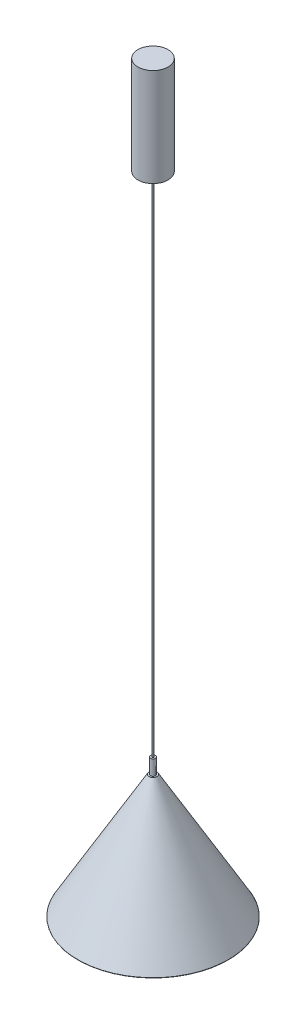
ISO-10303-21;
HEADER;
FILE_DESCRIPTION(('STEP AP214'),'2;1');
FILE_NAME('part.step','',(''),(''),'','','');
FILE_SCHEMA(('AUTOMOTIVE_DESIGN { 1 0 10303 214 1 1 1 1 }'));
ENDSEC;
DATA;
#1=APPLICATION_CONTEXT('core data for automotive mechanical design processes');
#2=APPLICATION_PROTOCOL_DEFINITION('international standard','automotive_design',2000,#1);
#3=PRODUCT_CONTEXT('',#1,'mechanical');
#4=PRODUCT('Part','Part','',(#3));
#5=PRODUCT_RELATED_PRODUCT_CATEGORY('part','',(#4));
#6=PRODUCT_DEFINITION_FORMATION('','',#4);
#7=PRODUCT_DEFINITION_CONTEXT('part definition',#1,'design');
#8=PRODUCT_DEFINITION('design','',#6,#7);
#9=PRODUCT_DEFINITION_SHAPE('','',#8);
#10=(LENGTH_UNIT() NAMED_UNIT(*) SI_UNIT(.MILLI.,.METRE.));
#11=(NAMED_UNIT(*) PLANE_ANGLE_UNIT() SI_UNIT($,.RADIAN.));
#12=(NAMED_UNIT(*) SI_UNIT($,.STERADIAN.) SOLID_ANGLE_UNIT());
#13=UNCERTAINTY_MEASURE_WITH_UNIT(LENGTH_MEASURE(1.E-05),#10,'distance_accuracy_value','');
#14=(GEOMETRIC_REPRESENTATION_CONTEXT(3) GLOBAL_UNCERTAINTY_ASSIGNED_CONTEXT((#13)) GLOBAL_UNIT_ASSIGNED_CONTEXT((#10,
#11,#12)) REPRESENTATION_CONTEXT('',''));
#15=CARTESIAN_POINT('',(0.,0.,0.));
#16=DIRECTION('',(0.,0.,1.));
#17=DIRECTION('',(1.,0.,0.));
#18=AXIS2_PLACEMENT_3D('',#15,#16,#17);
#19=CARTESIAN_POINT('',(-6.86601400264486,-882.372962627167,690.));
#20=DIRECTION('',(0.,1.,0.));
#21=DIRECTION('',(-0.979846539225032,0.,-0.199751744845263));
#22=AXIS2_PLACEMENT_3D('',#19,#20,#21);
#23=CYLINDRICAL_SURFACE('',#22,5.);
#24=CARTESIAN_POINT('',(-6.86601400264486,-882.372962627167,690.));
#25=DIRECTION('',(0.,-1.,0.));
#26=DIRECTION('',(0.979846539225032,0.,0.199751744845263));
#27=AXIS2_PLACEMENT_3D('',#24,#25,#26);
#28=CIRCLE('',#27,5.);
#29=CARTESIAN_POINT('',(-11.76524669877,-882.372962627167,689.001241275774));
#30=VERTEX_POINT('',#29);
#31=EDGE_CURVE('P0_E9',#30,#30,#28,.T.);
#32=CARTESIAN_POINT('',(-6.86601400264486,-882.362962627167,690.));
#33=DIRECTION('',(0.,-1.,0.));
#34=DIRECTION('',(0.979846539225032,0.,0.199751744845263));
#35=AXIS2_PLACEMENT_3D('',#32,#33,#34);
#36=CIRCLE('',#35,5.);
#37=CARTESIAN_POINT('',(-11.76524669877,-882.362962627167,689.001241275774));
#38=VERTEX_POINT('',#37);
#39=EDGE_CURVE('P0_E17',#38,#38,#36,.T.);
#40=CARTESIAN_POINT('',(-11.76524669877,-882.372962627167,689.001241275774));
#41=CARTESIAN_POINT('',(-11.76524669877,-882.3728584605,689.001241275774));
#42=CARTESIAN_POINT('',(-11.76524669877,-882.372754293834,689.001241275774));
#43=CARTESIAN_POINT('',(-11.76524669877,-882.3725459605,689.001241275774));
#44=CARTESIAN_POINT('',(-11.76524669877,-882.372441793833,689.001241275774));
#45=CARTESIAN_POINT('',(-11.76524669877,-882.3722334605,689.001241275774));
#46=CARTESIAN_POINT('',(-11.76524669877,-882.372129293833,689.001241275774));
#47=CARTESIAN_POINT('',(-11.76524669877,-882.3719209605,689.001241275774));
#48=CARTESIAN_POINT('',(-11.76524669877,-882.371816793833,689.001241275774));
#49=CARTESIAN_POINT('',(-11.76524669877,-882.3716084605,689.001241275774));
#50=CARTESIAN_POINT('',(-11.76524669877,-882.371504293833,689.001241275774));
#51=CARTESIAN_POINT('',(-11.76524669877,-882.3712959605,689.001241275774));
#52=CARTESIAN_POINT('',(-11.76524669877,-882.371191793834,689.001241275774));
#53=CARTESIAN_POINT('',(-11.76524669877,-882.3709834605,689.001241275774));
#54=CARTESIAN_POINT('',(-11.76524669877,-882.370879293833,689.001241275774));
#55=CARTESIAN_POINT('',(-11.76524669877,-882.3706709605,689.001241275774));
#56=CARTESIAN_POINT('',(-11.76524669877,-882.370566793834,689.001241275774));
#57=CARTESIAN_POINT('',(-11.76524669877,-882.3703584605,689.001241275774));
#58=CARTESIAN_POINT('',(-11.76524669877,-882.370254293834,689.001241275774));
#59=CARTESIAN_POINT('',(-11.76524669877,-882.3700459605,689.001241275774));
#60=CARTESIAN_POINT('',(-11.76524669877,-882.369941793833,689.001241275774));
#61=CARTESIAN_POINT('',(-11.76524669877,-882.3697334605,689.001241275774));
#62=CARTESIAN_POINT('',(-11.76524669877,-882.369629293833,689.001241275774));
#63=CARTESIAN_POINT('',(-11.76524669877,-882.3694209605,689.001241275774));
#64=CARTESIAN_POINT('',(-11.76524669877,-882.369316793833,689.001241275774));
#65=CARTESIAN_POINT('',(-11.76524669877,-882.3691084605,689.001241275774));
#66=CARTESIAN_POINT('',(-11.76524669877,-882.369004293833,689.001241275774));
#67=CARTESIAN_POINT('',(-11.76524669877,-882.3687959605,689.001241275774));
#68=CARTESIAN_POINT('',(-11.76524669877,-882.368691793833,689.001241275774));
#69=CARTESIAN_POINT('',(-11.76524669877,-882.3684834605,689.001241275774));
#70=CARTESIAN_POINT('',(-11.76524669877,-882.368379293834,689.001241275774));
#71=CARTESIAN_POINT('',(-11.76524669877,-882.3681709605,689.001241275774));
#72=CARTESIAN_POINT('',(-11.76524669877,-882.368066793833,689.001241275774));
#73=CARTESIAN_POINT('',(-11.76524669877,-882.3678584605,689.001241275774));
#74=CARTESIAN_POINT('',(-11.76524669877,-882.367754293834,689.001241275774));
#75=CARTESIAN_POINT('',(-11.76524669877,-882.3675459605,689.001241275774));
#76=CARTESIAN_POINT('',(-11.76524669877,-882.367441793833,689.001241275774));
#77=CARTESIAN_POINT('',(-11.76524669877,-882.3672334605,689.001241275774));
#78=CARTESIAN_POINT('',(-11.76524669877,-882.367129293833,689.001241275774));
#79=CARTESIAN_POINT('',(-11.76524669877,-882.3669209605,689.001241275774));
#80=CARTESIAN_POINT('',(-11.76524669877,-882.366816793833,689.001241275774));
#81=CARTESIAN_POINT('',(-11.76524669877,-882.3666084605,689.001241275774));
#82=CARTESIAN_POINT('',(-11.76524669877,-882.366504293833,689.001241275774));
#83=CARTESIAN_POINT('',(-11.76524669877,-882.3662959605,689.001241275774));
#84=CARTESIAN_POINT('',(-11.76524669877,-882.366191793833,689.001241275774));
#85=CARTESIAN_POINT('',(-11.76524669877,-882.3659834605,689.001241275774));
#86=CARTESIAN_POINT('',(-11.76524669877,-882.365879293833,689.001241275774));
#87=CARTESIAN_POINT('',(-11.76524669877,-882.3656709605,689.001241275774));
#88=CARTESIAN_POINT('',(-11.76524669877,-882.365566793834,689.001241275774));
#89=CARTESIAN_POINT('',(-11.76524669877,-882.3653584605,689.001241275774));
#90=CARTESIAN_POINT('',(-11.76524669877,-882.365254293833,689.001241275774));
#91=CARTESIAN_POINT('',(-11.76524669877,-882.3650459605,689.001241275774));
#92=CARTESIAN_POINT('',(-11.76524669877,-882.364941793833,689.001241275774));
#93=CARTESIAN_POINT('',(-11.76524669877,-882.3647334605,689.001241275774));
#94=CARTESIAN_POINT('',(-11.76524669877,-882.364629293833,689.001241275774));
#95=CARTESIAN_POINT('',(-11.76524669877,-882.3644209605,689.001241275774));
#96=CARTESIAN_POINT('',(-11.76524669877,-882.364316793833,689.001241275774));
#97=CARTESIAN_POINT('',(-11.76524669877,-882.3641084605,689.001241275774));
#98=CARTESIAN_POINT('',(-11.76524669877,-882.364004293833,689.001241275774));
#99=CARTESIAN_POINT('',(-11.76524669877,-882.3637959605,689.001241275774));
#100=CARTESIAN_POINT('',(-11.76524669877,-882.363691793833,689.001241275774));
#101=CARTESIAN_POINT('',(-11.76524669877,-882.3634834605,689.001241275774));
#102=CARTESIAN_POINT('',(-11.76524669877,-882.363379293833,689.001241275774));
#103=CARTESIAN_POINT('',(-11.76524669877,-882.3631709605,689.001241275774));
#104=CARTESIAN_POINT('',(-11.76524669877,-882.363066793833,689.001241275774));
#105=CARTESIAN_POINT('',(-11.76524669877,-882.362962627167,689.001241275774));
#106=B_SPLINE_CURVE_WITH_KNOTS('',3,(#40,#41,#42,#43,#44,#45,#46,#47,#48,#49,#50,#51,#52,#53,
#54,#55,#56,#57,#58,#59,#60,#61,#62,#63,#64,#65,#66,#67,#68,#69,#70,#71,#72,#73,#74,#75,#76,#77,
#78,#79,#80,#81,#82,#83,#84,#85,#86,#87,#88,#89,#90,#91,#92,#93,#94,#95,#96,#97,#98,#99,#100,
#101,#102,#103,#104,#105),.UNSPECIFIED.,.F.,.F.,(4,2,2,2,2,2,2,2,2,2,2,2,2,2,2,2,2,2,2,2,2,2,2,
2,2,2,2,2,2,2,2,2,4),(0.,0.000312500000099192,0.000625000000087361,0.000937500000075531,
0.0012500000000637,0.00156250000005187,0.00187500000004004,0.00218750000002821,
0.00250000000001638,0.00281250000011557,0.00312500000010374,0.00343750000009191,
0.00375000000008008,0.00406250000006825,0.00437500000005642,0.00468750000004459,
0.00500000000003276,0.00531250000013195,0.00562500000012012,0.00593750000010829,
0.00625000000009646,0.00656250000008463,0.0068750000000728,0.00718750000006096,
0.00750000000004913,0.00781250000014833,0.0081250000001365,0.00843750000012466,
0.00875000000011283,0.009062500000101,0.00937500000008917,0.00968750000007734,
0.0100000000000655),.UNSPECIFIED.);
#107=EDGE_CURVE('P0_BSEAM14',#30,#38,#106,.T.);
#108=ORIENTED_EDGE('',*,*,#31,.F.);
#109=ORIENTED_EDGE('',*,*,#39,.T.);
#110=ORIENTED_EDGE('',*,*,#107,.T.);
#111=ORIENTED_EDGE('',*,*,#107,.F.);
#112=EDGE_LOOP('',(#108,#110,#109,#111));
#113=FACE_BOUND('',#112,.T.);
#114=ADVANCED_FACE('P0_F14',(#113),#23,.T.);
#115=CARTESIAN_POINT('',(-6.86601400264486,-882.372962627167,690.));
#116=DIRECTION('',(0.,-1.,0.));
#117=DIRECTION('',(0.979846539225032,0.,0.199751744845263));
#118=AXIS2_PLACEMENT_3D('',#115,#116,#117);
#119=PLANE('',#118);
#120=ORIENTED_EDGE('',*,*,#31,.T.);
#121=EDGE_LOOP('',(#120));
#122=FACE_BOUND('',#121,.T.);
#123=ADVANCED_FACE('P0_F29',(#122),#119,.T.);
#124=CARTESIAN_POINT('',(-6.86601400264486,-882.362962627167,690.));
#125=DIRECTION('',(0.,-1.,0.));
#126=DIRECTION('',(0.979846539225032,0.,0.199751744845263));
#127=AXIS2_PLACEMENT_3D('',#124,#125,#126);
#128=PLANE('',#127);
#129=ORIENTED_EDGE('',*,*,#39,.F.);
#130=EDGE_LOOP('',(#129));
#131=FACE_BOUND('',#130,.T.);
#132=ADVANCED_FACE('P0_F27',(#131),#128,.F.);
#133=CLOSED_SHELL('',(#114,#123,#132));
#134=MANIFOLD_SOLID_BREP('P0_B1',#133);
#135=CARTESIAN_POINT('',(-6.86601400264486,-621.411747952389,690.));
#136=DIRECTION('',(0.,-1.,0.));
#137=DIRECTION('',(0.199751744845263,0.,-0.979846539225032));
#138=AXIS2_PLACEMENT_3D('',#135,#136,#137);
#139=CYLINDRICAL_SURFACE('',#138,5.);
#140=CARTESIAN_POINT('',(-6.86601400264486,-621.411747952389,690.));
#141=DIRECTION('',(0.,1.,0.));
#142=DIRECTION('',(-0.199751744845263,0.,0.979846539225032));
#143=AXIS2_PLACEMENT_3D('',#140,#141,#142);
#144=CIRCLE('',#143,5.);
#145=CARTESIAN_POINT('',(-7.86477272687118,-621.411747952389,694.899232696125));
#146=VERTEX_POINT('',#145);
#147=EDGE_CURVE('P1_E10',#146,#146,#144,.T.);
#148=ORIENTED_EDGE('',*,*,#147,.F.);
#149=EDGE_LOOP('',(#148));
#150=FACE_BOUND('',#149,.T.);
#151=CARTESIAN_POINT('',(-6.86601400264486,-651.411747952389,690.));
#152=DIRECTION('',(0.,1.,0.));
#153=DIRECTION('',(-0.199751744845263,0.,0.979846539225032));
#154=AXIS2_PLACEMENT_3D('',#151,#152,#153);
#155=CIRCLE('',#154,5.);
#156=CARTESIAN_POINT('',(-7.86477272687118,-651.411747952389,694.899232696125));
#157=VERTEX_POINT('',#156);
#158=EDGE_CURVE('P1_E18',#157,#157,#155,.T.);
#159=ORIENTED_EDGE('',*,*,#158,.T.);
#160=EDGE_LOOP('',(#159));
#161=FACE_BOUND('',#160,.T.);
#162=ADVANCED_FACE('P1_F15',(#150,#161),#139,.T.);
#163=CARTESIAN_POINT('',(-6.86601400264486,-621.411747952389,690.));
#164=DIRECTION('',(0.,1.,0.));
#165=DIRECTION('',(-0.199751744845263,0.,0.979846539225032));
#166=AXIS2_PLACEMENT_3D('',#163,#164,#165);
#167=PLANE('',#166);
#168=ORIENTED_EDGE('',*,*,#147,.T.);
#169=EDGE_LOOP('',(#168));
#170=FACE_BOUND('',#169,.T.);
#171=ADVANCED_FACE('P1_F30',(#170),#167,.T.);
#172=CARTESIAN_POINT('',(-6.86601400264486,-651.411747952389,690.));
#173=DIRECTION('',(0.,1.,0.));
#174=DIRECTION('',(-0.199751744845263,0.,0.979846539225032));
#175=AXIS2_PLACEMENT_3D('',#172,#173,#174);
#176=PLANE('',#175);
#177=ORIENTED_EDGE('',*,*,#158,.F.);
#178=EDGE_LOOP('',(#177));
#179=FACE_BOUND('',#178,.T.);
#180=ADVANCED_FACE('P1_F28',(#179),#176,.F.);
#181=CLOSED_SHELL('',(#162,#171,#180));
#182=MANIFOLD_SOLID_BREP('P1_B1',#181);
#183=CARTESIAN_POINT('',(-6.86601400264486,-880.362962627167,690.));
#184=DIRECTION('',(0.,-1.,0.));
#185=DIRECTION('',(0.979846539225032,0.,0.199751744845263));
#186=AXIS2_PLACEMENT_3D('',#183,#184,#185);
#187=PLANE('',#186);
#188=CARTESIAN_POINT('',(-6.86601400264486,-880.362962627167,690.));
#189=DIRECTION('',(0.,-1.,0.));
#190=DIRECTION('',(0.979846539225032,0.,0.199751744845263));
#191=AXIS2_PLACEMENT_3D('',#188,#189,#190);
#192=CIRCLE('',#191,136.845299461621);
#193=CARTESIAN_POINT('',(127.221379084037,-880.362962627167,717.335087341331));
#194=VERTEX_POINT('',#193);
#195=EDGE_CURVE('P2_E10',#194,#194,#192,.T.);
#196=ORIENTED_EDGE('',*,*,#195,.F.);
#197=EDGE_LOOP('',(#196));
#198=FACE_BOUND('',#197,.T.);
#199=ADVANCED_FACE('P2_F15',(#198),#187,.F.);
#200=CARTESIAN_POINT('',(-6.86601400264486,-880.362962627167,690.));
#201=DIRECTION('',(0.,-1.,0.));
#202=DIRECTION('',(0.979846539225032,0.,0.199751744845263));
#203=AXIS2_PLACEMENT_3D('',#200,#201,#202);
#204=CONICAL_SURFACE('',#203,136.845299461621,0.52359877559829);
#205=CARTESIAN_POINT('',(-6.86601400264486,-882.362962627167,690.));
#206=DIRECTION('',(0.,-1.,0.));
#207=DIRECTION('',(0.979846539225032,0.,0.199751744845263));
#208=AXIS2_PLACEMENT_3D('',#205,#206,#207);
#209=CIRCLE('',#208,138.);
#210=CARTESIAN_POINT('',(128.35280841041,-882.362962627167,717.565740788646));
#211=VERTEX_POINT('',#210);
#212=EDGE_CURVE('P2_E21',#211,#211,#209,.T.);
#213=ORIENTED_EDGE('',*,*,#212,.F.);
#214=EDGE_LOOP('',(#213));
#215=FACE_BOUND('',#214,.T.);
#216=ORIENTED_EDGE('',*,*,#195,.T.);
#217=EDGE_LOOP('',(#216));
#218=FACE_BOUND('',#217,.T.);
#219=ADVANCED_FACE('P2_F29',(#215,#218),#204,.T.);
#220=CARTESIAN_POINT('',(-142.084836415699,-882.362962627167,662.434259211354));
#221=DIRECTION('',(0.,1.,0.));
#222=DIRECTION('',(-0.979846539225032,0.,-0.199751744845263));
#223=AXIS2_PLACEMENT_3D('',#220,#221,#222);
#224=PLANE('',#223);
#225=ORIENTED_EDGE('',*,*,#212,.T.);
#226=EDGE_LOOP('',(#225));
#227=FACE_BOUND('',#226,.T.);
#228=ADVANCED_FACE('P2_F27',(#227),#224,.F.);
#229=CLOSED_SHELL('',(#199,#219,#228));
#230=MANIFOLD_SOLID_BREP('P2_B1',#229);
#231=CARTESIAN_POINT('',(-6.86601400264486,-651.411747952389,690.));
#232=DIRECTION('',(0.,-1.,0.));
#233=DIRECTION('',(0.199751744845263,0.,-0.979846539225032));
#234=AXIS2_PLACEMENT_3D('',#231,#232,#233);
#235=PLANE('',#234);
#236=CARTESIAN_POINT('',(-6.86601400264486,-651.411747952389,690.));
#237=DIRECTION('',(0.,-1.,0.));
#238=DIRECTION('',(0.199751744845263,0.,-0.979846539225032));
#239=AXIS2_PLACEMENT_3D('',#236,#237,#238);
#240=CIRCLE('',#239,8.);
#241=CARTESIAN_POINT('',(-5.26800004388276,-651.411747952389,682.1612276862));
#242=VERTEX_POINT('',#241);
#243=EDGE_CURVE('P3_E35',#242,#242,#240,.T.);
#244=ORIENTED_EDGE('',*,*,#243,.F.);
#245=EDGE_LOOP('',(#244));
#246=FACE_BOUND('',#245,.T.);
#247=ADVANCED_FACE('P3_F15',(#246),#235,.F.);
#248=CARTESIAN_POINT('',(-6.86601400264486,-651.411747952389,690.));
#249=DIRECTION('',(0.,-1.,0.));
#250=DIRECTION('',(0.199751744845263,0.,-0.979846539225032));
#251=AXIS2_PLACEMENT_3D('',#248,#249,#250);
#252=CONICAL_SURFACE('',#251,8.,0.523598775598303);
#253=CARTESIAN_POINT('',(-6.86601400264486,-896.612962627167,690.));
#254=DIRECTION('',(0.,1.,0.));
#255=DIRECTION('',(-0.199751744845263,0.,0.979846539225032));
#256=AXIS2_PLACEMENT_3D('',#253,#254,#255);
#257=CIRCLE('',#256,149.566987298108);
#258=CARTESIAN_POINT('',(23.0102526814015,-896.612962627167,543.447305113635));
#259=VERTEX_POINT('',#258);
#260=EDGE_CURVE('P3_E22',#259,#259,#257,.T.);
#261=CARTESIAN_POINT('',(23.0102526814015,-896.612962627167,543.447305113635));
#262=CARTESIAN_POINT('',(22.7156875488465,-894.058783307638,544.892241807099));
#263=CARTESIAN_POINT('',(22.4211224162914,-891.504603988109,546.337178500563));
#264=CARTESIAN_POINT('',(21.8319921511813,-886.396245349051,549.227051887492));
#265=CARTESIAN_POINT('',(21.5374270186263,-883.842066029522,550.671988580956));
#266=CARTESIAN_POINT('',(20.9482967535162,-878.733707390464,553.561861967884));
#267=CARTESIAN_POINT('',(20.6537316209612,-876.179528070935,555.006798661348));
#268=CARTESIAN_POINT('',(20.0646013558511,-871.071169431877,557.896672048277));
#269=CARTESIAN_POINT('',(19.770036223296,-868.516990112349,559.341608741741));
#270=CARTESIAN_POINT('',(19.1809059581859,-863.408631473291,562.23148212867));
#271=CARTESIAN_POINT('',(18.8863408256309,-860.854452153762,563.676418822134));
#272=CARTESIAN_POINT('',(18.2972105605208,-855.746093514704,566.566292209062));
#273=CARTESIAN_POINT('',(18.0026454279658,-853.191914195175,568.011228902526));
#274=CARTESIAN_POINT('',(17.4135151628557,-848.083555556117,570.901102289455));
#275=CARTESIAN_POINT('',(17.1189500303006,-845.529376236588,572.346038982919));
#276=CARTESIAN_POINT('',(16.5298197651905,-840.42101759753,575.235912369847));
#277=CARTESIAN_POINT('',(16.2352546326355,-837.866838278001,576.680849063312));
#278=CARTESIAN_POINT('',(15.6461243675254,-832.758479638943,579.57072245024));
#279=CARTESIAN_POINT('',(15.3515592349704,-830.204300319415,581.015659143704));
#280=CARTESIAN_POINT('',(14.7624289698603,-825.095941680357,583.905532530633));
#281=CARTESIAN_POINT('',(14.4678638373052,-822.541762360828,585.350469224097));
#282=CARTESIAN_POINT('',(13.8787335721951,-817.43340372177,588.240342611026));
#283=CARTESIAN_POINT('',(13.5841684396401,-814.879224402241,589.68527930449));
#284=CARTESIAN_POINT('',(12.99503817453,-809.770865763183,592.575152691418));
#285=CARTESIAN_POINT('',(12.700473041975,-807.216686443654,594.020089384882));
#286=CARTESIAN_POINT('',(12.1113427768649,-802.108327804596,596.909962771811));
#287=CARTESIAN_POINT('',(11.8167776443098,-799.554148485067,598.354899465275));
#288=CARTESIAN_POINT('',(11.2276473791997,-794.445789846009,601.244772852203));
#289=CARTESIAN_POINT('',(10.9330822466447,-791.89161052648,602.689709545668));
#290=CARTESIAN_POINT('',(10.3439519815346,-786.783251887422,605.579582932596));
#291=CARTESIAN_POINT('',(10.0493868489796,-784.229072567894,607.02451962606));
#292=CARTESIAN_POINT('',(9.46025658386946,-779.120713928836,609.914393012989));
#293=CARTESIAN_POINT('',(9.16569145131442,-776.566534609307,611.359329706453));
#294=CARTESIAN_POINT('',(8.57656118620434,-771.458175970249,614.249203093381));
#295=CARTESIAN_POINT('',(8.28199605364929,-768.90399665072,615.694139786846));
#296=CARTESIAN_POINT('',(7.6928657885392,-763.795638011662,618.584013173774));
#297=CARTESIAN_POINT('',(7.39830065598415,-761.241458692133,620.028949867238));
#298=CARTESIAN_POINT('',(6.80917039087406,-756.133100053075,622.918823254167));
#299=CARTESIAN_POINT('',(6.51460525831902,-753.578920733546,624.363759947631));
#300=CARTESIAN_POINT('',(5.92547499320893,-748.470562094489,627.253633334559));
#301=CARTESIAN_POINT('',(5.63090986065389,-745.91638277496,628.698570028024));
#302=CARTESIAN_POINT('',(5.0417795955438,-740.808024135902,631.588443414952));
#303=CARTESIAN_POINT('',(4.74721446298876,-738.253844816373,633.033380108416));
#304=CARTESIAN_POINT('',(4.15808419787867,-733.145486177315,635.923253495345));
#305=CARTESIAN_POINT('',(3.86351906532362,-730.591306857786,637.368190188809));
#306=CARTESIAN_POINT('',(3.27438880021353,-725.482948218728,640.258063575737));
#307=CARTESIAN_POINT('',(2.97982366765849,-722.928768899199,641.703000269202));
#308=CARTESIAN_POINT('',(2.3906934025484,-717.820410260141,644.59287365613));
#309=CARTESIAN_POINT('',(2.09612826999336,-715.266230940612,646.037810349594));
#310=CARTESIAN_POINT('',(1.50699800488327,-710.157872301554,648.927683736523));
#311=CARTESIAN_POINT('',(1.21243287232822,-707.603692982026,650.372620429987));
#312=CARTESIAN_POINT('',(0.623302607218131,-702.495334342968,653.262493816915));
#313=CARTESIAN_POINT('',(0.328737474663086,-699.941155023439,654.707430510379));
#314=CARTESIAN_POINT('',(-0.260392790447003,-694.832796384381,657.597303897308));
#315=CARTESIAN_POINT('',(-0.554957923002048,-692.278617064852,659.042240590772));
#316=CARTESIAN_POINT('',(-1.14408818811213,-687.170258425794,661.932113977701));
#317=CARTESIAN_POINT('',(-1.43865332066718,-684.616079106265,663.377050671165));
#318=CARTESIAN_POINT('',(-2.02778358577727,-679.507720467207,666.266924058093));
#319=CARTESIAN_POINT('',(-2.32234871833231,-676.953541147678,667.711860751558));
#320=CARTESIAN_POINT('',(-2.9114789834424,-671.84518250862,670.601734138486));
#321=CARTESIAN_POINT('',(-3.20604411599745,-669.291003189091,672.04667083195));
#322=CARTESIAN_POINT('',(-3.79517438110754,-664.182644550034,674.936544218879));
#323=CARTESIAN_POINT('',(-4.08973951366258,-661.628465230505,676.381480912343));
#324=CARTESIAN_POINT('',(-4.67886977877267,-656.520106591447,679.271354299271));
#325=CARTESIAN_POINT('',(-4.97343491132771,-653.965927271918,680.716290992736));
#326=CARTESIAN_POINT('',(-5.26800004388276,-651.411747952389,682.1612276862));
#327=B_SPLINE_CURVE_WITH_KNOTS('',3,(#261,#262,#263,#264,#265,#266,#267,#268,#269,#270,#271,
#272,#273,#274,#275,#276,#277,#278,#279,#280,#281,#282,#283,#284,#285,#286,#287,#288,#289,#290,
#291,#292,#293,#294,#295,#296,#297,#298,#299,#300,#301,#302,#303,#304,#305,#306,#307,#308,#309,
#310,#311,#312,#313,#314,#315,#316,#317,#318,#319,#320,#321,#322,#323,#324,#325,#326),
.UNSPECIFIED.,.F.,.F.,(4,2,2,2,2,2,2,2,2,2,2,2,2,2,2,2,2,2,2,2,2,2,2,2,2,2,2,2,2,2,2,2,4),(0.,
8.84793670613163,17.6958734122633,26.543810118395,35.3917468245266,44.2396835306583,
53.08762023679,61.9355569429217,70.7834936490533,79.631430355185,88.4793670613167,
97.3273037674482,106.17524047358,115.023177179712,123.871113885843,132.719050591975,
141.566987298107,150.414924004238,159.26286071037,168.110797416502,176.958734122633,
185.806670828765,194.654607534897,203.502544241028,212.35048094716,221.198417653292,
230.046354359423,238.894291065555,247.742227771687,256.590164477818,265.43810118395,
274.286037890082,283.133974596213),.UNSPECIFIED.);
#328=EDGE_CURVE('P3_BSEAM58',#259,#242,#327,.T.);
#329=ORIENTED_EDGE('',*,*,#260,.T.);
#330=ORIENTED_EDGE('',*,*,#243,.T.);
#331=ORIENTED_EDGE('',*,*,#328,.T.);
#332=ORIENTED_EDGE('',*,*,#328,.F.);
#333=EDGE_LOOP('',(#329,#331,#330,#332));
#334=FACE_BOUND('',#333,.T.);
#335=ADVANCED_FACE('P3_F58',(#334),#252,.T.);
#336=CARTESIAN_POINT('',(-6.86601400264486,-897.362962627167,690.));
#337=DIRECTION('',(0.,1.,0.));
#338=DIRECTION('',(-0.199751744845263,0.,0.979846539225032));
#339=AXIS2_PLACEMENT_3D('',#336,#337,#338);
#340=PLANE('',#339);
#341=CARTESIAN_POINT('',(-6.86601400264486,-897.362962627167,690.));
#342=DIRECTION('',(0.,1.,0.));
#343=DIRECTION('',(-0.199751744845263,0.,0.979846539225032));
#344=AXIS2_PLACEMENT_3D('',#341,#342,#343);
#345=CIRCLE('',#344,149.133974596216);
#346=CARTESIAN_POINT('',(-36.6557856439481,-897.362962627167,836.128408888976));
#347=VERTEX_POINT('',#346);
#348=EDGE_CURVE('P3_E26',#347,#347,#345,.F.);
#349=ORIENTED_EDGE('',*,*,#348,.T.);
#350=EDGE_LOOP('',(#349));
#351=FACE_BOUND('',#350,.T.);
#352=CARTESIAN_POINT('',(-6.86601400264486,-897.362962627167,690.));
#353=DIRECTION('',(0.,1.,0.));
#354=DIRECTION('',(-0.199751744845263,0.,0.979846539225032));
#355=AXIS2_PLACEMENT_3D('',#352,#353,#354);
#356=CIRCLE('',#355,147.979274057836);
#357=CARTESIAN_POINT('',(-36.4251321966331,-897.362962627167,834.996979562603));
#358=VERTEX_POINT('',#357);
#359=EDGE_CURVE('P3_E30',#358,#358,#356,.T.);
#360=ORIENTED_EDGE('',*,*,#359,.T.);
#361=EDGE_LOOP('',(#360));
#362=FACE_BOUND('',#361,.T.);
#363=ADVANCED_FACE('P3_F54',(#351,#362),#340,.F.);
#364=CARTESIAN_POINT('',(-6.86601400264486,-653.411747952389,690.));
#365=DIRECTION('',(0.,-1.,0.));
#366=DIRECTION('',(0.199751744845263,0.,-0.979846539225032));
#367=AXIS2_PLACEMENT_3D('',#364,#365,#366);
#368=PLANE('',#367);
#369=CARTESIAN_POINT('',(-6.86601400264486,-653.411747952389,690.));
#370=DIRECTION('',(0.,-1.,0.));
#371=DIRECTION('',(0.199751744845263,0.,-0.979846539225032));
#372=AXIS2_PLACEMENT_3D('',#369,#370,#371);
#373=CIRCLE('',#372,6.84529946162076);
#374=CARTESIAN_POINT('',(-5.49865349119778,-653.411747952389,683.292657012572));
#375=VERTEX_POINT('',#374);
#376=EDGE_CURVE('P3_E38',#375,#375,#373,.T.);
#377=ORIENTED_EDGE('',*,*,#376,.T.);
#378=EDGE_LOOP('',(#377));
#379=FACE_BOUND('',#378,.T.);
#380=ADVANCED_FACE('P3_F42',(#379),#368,.T.);
#381=CARTESIAN_POINT('',(-6.86601400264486,-652.411747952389,690.));
#382=DIRECTION('',(0.,-1.,0.));
#383=DIRECTION('',(0.199751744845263,0.,-0.979846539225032));
#384=AXIS2_PLACEMENT_3D('',#381,#382,#383);
#385=CONICAL_SURFACE('',#384,6.26794919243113,0.523598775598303);
#386=CARTESIAN_POINT('',(-6.86601400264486,-897.112962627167,690.));
#387=DIRECTION('',(0.,-1.,0.));
#388=DIRECTION('',(0.199751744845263,0.,-0.979846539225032));
#389=AXIS2_PLACEMENT_3D('',#386,#387,#388);
#390=CIRCLE('',#389,147.546261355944);
#391=CARTESIAN_POINT('',(22.6066091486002,-897.112962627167,545.427306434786));
#392=VERTEX_POINT('',#391);
#393=EDGE_CURVE('P3_E10',#392,#392,#390,.T.);
#394=CARTESIAN_POINT('',(22.6066091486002,-897.112962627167,545.427306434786));
#395=CARTESIAN_POINT('',(22.3138459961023,-894.574408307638,546.863403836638));
#396=CARTESIAN_POINT('',(22.0210828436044,-892.035853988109,548.29950123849));
#397=CARTESIAN_POINT('',(21.4355565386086,-886.958745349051,551.171696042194));
#398=CARTESIAN_POINT('',(21.1427933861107,-884.420191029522,552.607793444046));
#399=CARTESIAN_POINT('',(20.557267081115,-879.343082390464,555.47998824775));
#400=CARTESIAN_POINT('',(20.2645039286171,-876.804528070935,556.916085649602));
#401=CARTESIAN_POINT('',(19.6789776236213,-871.727419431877,559.788280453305));
#402=CARTESIAN_POINT('',(19.3862144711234,-869.188865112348,561.224377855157));
#403=CARTESIAN_POINT('',(18.8006881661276,-864.111756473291,564.096572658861));
#404=CARTESIAN_POINT('',(18.5079250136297,-861.573202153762,565.532670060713));
#405=CARTESIAN_POINT('',(17.9223987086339,-856.496093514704,568.404864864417));
#406=CARTESIAN_POINT('',(17.629635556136,-853.957539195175,569.840962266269));
#407=CARTESIAN_POINT('',(17.0441092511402,-848.880430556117,572.713157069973));
#408=CARTESIAN_POINT('',(16.7513460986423,-846.341876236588,574.149254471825));
#409=CARTESIAN_POINT('',(16.1658197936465,-841.26476759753,577.021449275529));
#410=CARTESIAN_POINT('',(15.8730566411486,-838.726213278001,578.457546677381));
#411=CARTESIAN_POINT('',(15.2875303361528,-833.649104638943,581.329741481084));
#412=CARTESIAN_POINT('',(14.9947671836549,-831.110550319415,582.765838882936));
#413=CARTESIAN_POINT('',(14.4092408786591,-826.033441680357,585.63803368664));
#414=CARTESIAN_POINT('',(14.1164777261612,-823.494887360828,587.074131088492));
#415=CARTESIAN_POINT('',(13.5309514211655,-818.41777872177,589.946325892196));
#416=CARTESIAN_POINT('',(13.2381882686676,-815.879224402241,591.382423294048));
#417=CARTESIAN_POINT('',(12.6526619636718,-810.802115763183,594.254618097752));
#418=CARTESIAN_POINT('',(12.3598988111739,-808.263561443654,595.690715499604));
#419=CARTESIAN_POINT('',(11.7743725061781,-803.186452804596,598.562910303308));
#420=CARTESIAN_POINT('',(11.4816093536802,-800.647898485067,599.99900770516));
#421=CARTESIAN_POINT('',(10.8960830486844,-795.570789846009,602.871202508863));
#422=CARTESIAN_POINT('',(10.6033198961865,-793.03223552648,604.307299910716));
#423=CARTESIAN_POINT('',(10.0177935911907,-787.955126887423,607.179494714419));
#424=CARTESIAN_POINT('',(9.7250304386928,-785.416572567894,608.615592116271));
#425=CARTESIAN_POINT('',(9.13950413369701,-780.339463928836,611.487786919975));
#426=CARTESIAN_POINT('',(8.84674098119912,-777.800909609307,612.923884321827));
#427=CARTESIAN_POINT('',(8.26121467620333,-772.723800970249,615.796079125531));
#428=CARTESIAN_POINT('',(7.96845152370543,-770.18524665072,617.232176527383));
#429=CARTESIAN_POINT('',(7.38292521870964,-765.108138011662,620.104371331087));
#430=CARTESIAN_POINT('',(7.09016206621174,-762.569583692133,621.540468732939));
#431=CARTESIAN_POINT('',(6.50463576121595,-757.492475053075,624.412663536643));
#432=CARTESIAN_POINT('',(6.21187260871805,-754.953920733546,625.848760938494));
#433=CARTESIAN_POINT('',(5.62634630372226,-749.876812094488,628.720955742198));
#434=CARTESIAN_POINT('',(5.33358315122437,-747.33825777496,630.15705314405));
#435=CARTESIAN_POINT('',(4.74805684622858,-742.261149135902,633.029247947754));
#436=CARTESIAN_POINT('',(4.45529369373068,-739.722594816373,634.465345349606));
#437=CARTESIAN_POINT('',(3.86976738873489,-734.645486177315,637.33754015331));
#438=CARTESIAN_POINT('',(3.57700423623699,-732.106931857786,638.773637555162));
#439=CARTESIAN_POINT('',(2.9914779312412,-727.029823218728,641.645832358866));
#440=CARTESIAN_POINT('',(2.69871477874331,-724.491268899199,643.081929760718));
#441=CARTESIAN_POINT('',(2.11318847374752,-719.414160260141,645.954124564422));
#442=CARTESIAN_POINT('',(1.82042532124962,-716.875605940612,647.390221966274));
#443=CARTESIAN_POINT('',(1.23489901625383,-711.798497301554,650.262416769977));
#444=CARTESIAN_POINT('',(0.94213586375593,-709.259942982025,651.698514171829));
#445=CARTESIAN_POINT('',(0.356609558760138,-704.182834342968,654.570708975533));
#446=CARTESIAN_POINT('',(0.0638464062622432,-701.644280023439,656.006806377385));
#447=CARTESIAN_POINT('',(-0.521679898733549,-696.567171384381,658.879001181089));
#448=CARTESIAN_POINT('',(-0.814443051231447,-694.028617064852,660.315098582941));
#449=CARTESIAN_POINT('',(-1.39996935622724,-688.951508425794,663.187293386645));
#450=CARTESIAN_POINT('',(-1.69273250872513,-686.412954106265,664.623390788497));
#451=CARTESIAN_POINT('',(-2.27825881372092,-681.335845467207,667.495585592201));
#452=CARTESIAN_POINT('',(-2.57102196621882,-678.797291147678,668.931682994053));
#453=CARTESIAN_POINT('',(-3.15654827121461,-673.72018250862,671.803877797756));
#454=CARTESIAN_POINT('',(-3.44931142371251,-671.181628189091,673.239975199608));
#455=CARTESIAN_POINT('',(-4.0348377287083,-666.104519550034,676.112170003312));
#456=CARTESIAN_POINT('',(-4.32760088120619,-663.565965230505,677.548267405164));
#457=CARTESIAN_POINT('',(-4.91312718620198,-658.488856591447,680.420462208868));
#458=CARTESIAN_POINT('',(-5.20589033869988,-655.950302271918,681.85655961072));
#459=CARTESIAN_POINT('',(-5.49865349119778,-653.411747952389,683.292657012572));
#460=B_SPLINE_CURVE_WITH_KNOTS('',3,(#394,#395,#396,#397,#398,#399,#400,#401,#402,#403,#404,
#405,#406,#407,#408,#409,#410,#411,#412,#413,#414,#415,#416,#417,#418,#419,#420,#421,#422,#423,
#424,#425,#426,#427,#428,#429,#430,#431,#432,#433,#434,#435,#436,#437,#438,#439,#440,#441,#442,
#443,#444,#445,#446,#447,#448,#449,#450,#451,#452,#453,#454,#455,#456,#457,#458,#459),
.UNSPECIFIED.,.F.,.F.,(4,2,2,2,2,2,2,2,2,2,2,2,2,2,2,2,2,2,2,2,2,2,2,2,2,2,2,2,2,2,2,2,4),(0.,
8.79381011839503,17.5876202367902,26.3814303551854,35.1752404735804,43.9690505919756,
52.7628607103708,61.556670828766,70.350480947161,79.1442910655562,87.9381011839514,
96.7319113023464,105.525721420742,114.319531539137,123.113341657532,131.907151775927,
140.700961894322,149.494772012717,158.288582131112,167.082392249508,175.876202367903,
184.670012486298,193.463822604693,202.257632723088,211.051442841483,219.845252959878,
228.639063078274,237.432873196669,246.226683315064,255.020493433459,263.814303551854,
272.608113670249,281.401923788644),.UNSPECIFIED.);
#461=EDGE_CURVE('P3_BSEAM44',#392,#375,#460,.T.);
#462=ORIENTED_EDGE('',*,*,#393,.T.);
#463=ORIENTED_EDGE('',*,*,#376,.F.);
#464=ORIENTED_EDGE('',*,*,#461,.T.);
#465=ORIENTED_EDGE('',*,*,#461,.F.);
#466=EDGE_LOOP('',(#462,#464,#463,#465));
#467=FACE_BOUND('',#466,.T.);
#468=ADVANCED_FACE('P3_F44',(#467),#385,.F.);
#469=CARTESIAN_POINT('',(-6.86601400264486,-896.862962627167,690.));
#470=DIRECTION('',(0.,1.,0.));
#471=DIRECTION('',(-0.199751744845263,0.,0.979846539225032));
#472=AXIS2_PLACEMENT_3D('',#469,#470,#471);
#473=TOROIDAL_SURFACE('',#472,149.133974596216,0.5);
#474=ORIENTED_EDGE('',*,*,#260,.F.);
#475=EDGE_LOOP('',(#474));
#476=FACE_BOUND('',#475,.T.);
#477=ORIENTED_EDGE('',*,*,#348,.F.);
#478=EDGE_LOOP('',(#477));
#479=FACE_BOUND('',#478,.T.);
#480=ADVANCED_FACE('P3_F46',(#476,#479),#473,.T.);
#481=CARTESIAN_POINT('',(-6.86601400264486,-896.862962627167,690.));
#482=DIRECTION('',(0.,1.,0.));
#483=DIRECTION('',(-0.199751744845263,0.,0.979846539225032));
#484=AXIS2_PLACEMENT_3D('',#481,#482,#483);
#485=TOROIDAL_SURFACE('',#484,147.979274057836,0.5);
#486=ORIENTED_EDGE('',*,*,#359,.F.);
#487=EDGE_LOOP('',(#486));
#488=FACE_BOUND('',#487,.T.);
#489=ORIENTED_EDGE('',*,*,#393,.F.);
#490=EDGE_LOOP('',(#489));
#491=FACE_BOUND('',#490,.T.);
#492=ADVANCED_FACE('P3_F17',(#488,#491),#485,.T.);
#493=CLOSED_SHELL('',(#247,#335,#363,#380,#468,#480,#492));
#494=MANIFOLD_SOLID_BREP('P3_B1',#493);
#495=CARTESIAN_POINT('',(-6.86601400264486,583.588252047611,690.));
#496=DIRECTION('',(0.,-1.,0.));
#497=DIRECTION('',(0.,0.,-1.));
#498=AXIS2_PLACEMENT_3D('',#495,#496,#497);
#499=CYLINDRICAL_SURFACE('',#498,30.);
#500=CARTESIAN_POINT('',(-6.86601400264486,583.588252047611,690.));
#501=DIRECTION('',(0.,1.,0.));
#502=DIRECTION('',(0.,0.,1.));
#503=AXIS2_PLACEMENT_3D('',#500,#501,#502);
#504=CIRCLE('',#503,30.);
#505=CARTESIAN_POINT('',(-6.86601400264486,583.588252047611,720.));
#506=VERTEX_POINT('',#505);
#507=EDGE_CURVE('P4_E10',#506,#506,#504,.T.);
#508=ORIENTED_EDGE('',*,*,#507,.F.);
#509=EDGE_LOOP('',(#508));
#510=FACE_BOUND('',#509,.T.);
#511=CARTESIAN_POINT('',(-6.86601400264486,388.588252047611,690.));
#512=DIRECTION('',(0.,1.,0.));
#513=DIRECTION('',(0.,0.,1.));
#514=AXIS2_PLACEMENT_3D('',#511,#512,#513);
#515=CIRCLE('',#514,30.);
#516=CARTESIAN_POINT('',(-6.86601400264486,388.588252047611,720.));
#517=VERTEX_POINT('',#516);
#518=EDGE_CURVE('P4_E18',#517,#517,#515,.T.);
#519=ORIENTED_EDGE('',*,*,#518,.T.);
#520=EDGE_LOOP('',(#519));
#521=FACE_BOUND('',#520,.T.);
#522=ADVANCED_FACE('P4_F15',(#510,#521),#499,.T.);
#523=CARTESIAN_POINT('',(-6.86601400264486,583.588252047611,690.));
#524=DIRECTION('',(0.,1.,0.));
#525=DIRECTION('',(0.,0.,1.));
#526=AXIS2_PLACEMENT_3D('',#523,#524,#525);
#527=PLANE('',#526);
#528=ORIENTED_EDGE('',*,*,#507,.T.);
#529=EDGE_LOOP('',(#528));
#530=FACE_BOUND('',#529,.T.);
#531=ADVANCED_FACE('P4_F30',(#530),#527,.T.);
#532=CARTESIAN_POINT('',(-6.86601400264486,388.588252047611,690.));
#533=DIRECTION('',(0.,1.,0.));
#534=DIRECTION('',(0.,0.,1.));
#535=AXIS2_PLACEMENT_3D('',#532,#533,#534);
#536=PLANE('',#535);
#537=ORIENTED_EDGE('',*,*,#518,.F.);
#538=EDGE_LOOP('',(#537));
#539=FACE_BOUND('',#538,.T.);
#540=ADVANCED_FACE('P4_F28',(#539),#536,.F.);
#541=CLOSED_SHELL('',(#522,#531,#540));
#542=MANIFOLD_SOLID_BREP('P4_B1',#541);
#543=CARTESIAN_POINT('',(-6.86601400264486,-621.411747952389,690.));
#544=DIRECTION('',(0.,1.,0.));
#545=DIRECTION('',(0.,0.,1.));
#546=AXIS2_PLACEMENT_3D('',#543,#544,#545);
#547=CYLINDRICAL_SURFACE('',#546,1.5);
#548=CARTESIAN_POINT('',(-6.86601400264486,-621.411747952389,690.));
#549=DIRECTION('',(0.,-1.,0.));
#550=DIRECTION('',(0.,0.,-1.));
#551=AXIS2_PLACEMENT_3D('',#548,#549,#550);
#552=CIRCLE('',#551,1.5);
#553=CARTESIAN_POINT('',(-6.86601400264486,-621.411747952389,688.5));
#554=VERTEX_POINT('',#553);
#555=EDGE_CURVE('P5_E10',#554,#554,#552,.T.);
#556=ORIENTED_EDGE('',*,*,#555,.F.);
#557=EDGE_LOOP('',(#556));
#558=FACE_BOUND('',#557,.T.);
#559=CARTESIAN_POINT('',(-6.86601400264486,378.588252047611,690.));
#560=DIRECTION('',(0.,-1.,0.));
#561=DIRECTION('',(0.,0.,-1.));
#562=AXIS2_PLACEMENT_3D('',#559,#560,#561);
#563=CIRCLE('',#562,1.5);
#564=CARTESIAN_POINT('',(-6.86601400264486,378.588252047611,688.5));
#565=VERTEX_POINT('',#564);
#566=EDGE_CURVE('P5_E18',#565,#565,#563,.T.);
#567=ORIENTED_EDGE('',*,*,#566,.T.);
#568=EDGE_LOOP('',(#567));
#569=FACE_BOUND('',#568,.T.);
#570=ADVANCED_FACE('P5_F15',(#558,#569),#547,.T.);
#571=CARTESIAN_POINT('',(-6.86601400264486,-621.411747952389,690.));
#572=DIRECTION('',(0.,-1.,0.));
#573=DIRECTION('',(0.,0.,-1.));
#574=AXIS2_PLACEMENT_3D('',#571,#572,#573);
#575=PLANE('',#574);
#576=ORIENTED_EDGE('',*,*,#555,.T.);
#577=EDGE_LOOP('',(#576));
#578=FACE_BOUND('',#577,.T.);
#579=ADVANCED_FACE('P5_F30',(#578),#575,.T.);
#580=CARTESIAN_POINT('',(-6.86601400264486,378.588252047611,690.));
#581=DIRECTION('',(0.,-1.,0.));
#582=DIRECTION('',(0.,0.,-1.));
#583=AXIS2_PLACEMENT_3D('',#580,#581,#582);
#584=PLANE('',#583);
#585=ORIENTED_EDGE('',*,*,#566,.F.);
#586=EDGE_LOOP('',(#585));
#587=FACE_BOUND('',#586,.T.);
#588=ADVANCED_FACE('P5_F28',(#587),#584,.F.);
#589=CLOSED_SHELL('',(#570,#579,#588));
#590=MANIFOLD_SOLID_BREP('P5_B1',#589);
#591=CARTESIAN_POINT('',(-6.86601400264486,378.588252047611,690.));
#592=DIRECTION('',(0.,1.,0.));
#593=DIRECTION('',(0.,0.,1.));
#594=AXIS2_PLACEMENT_3D('',#591,#592,#593);
#595=CYLINDRICAL_SURFACE('',#594,6.);
#596=CARTESIAN_POINT('',(-6.86601400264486,378.588252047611,690.));
#597=DIRECTION('',(0.,-1.,0.));
#598=DIRECTION('',(0.,0.,-1.));
#599=AXIS2_PLACEMENT_3D('',#596,#597,#598);
#600=CIRCLE('',#599,6.);
#601=CARTESIAN_POINT('',(-6.86601400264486,378.588252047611,684.));
#602=VERTEX_POINT('',#601);
#603=EDGE_CURVE('P6_E10',#602,#602,#600,.T.);
#604=ORIENTED_EDGE('',*,*,#603,.F.);
#605=EDGE_LOOP('',(#604));
#606=FACE_BOUND('',#605,.T.);
#607=CARTESIAN_POINT('',(-6.86601400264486,388.588252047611,690.));
#608=DIRECTION('',(0.,-1.,0.));
#609=DIRECTION('',(0.,0.,-1.));
#610=AXIS2_PLACEMENT_3D('',#607,#608,#609);
#611=CIRCLE('',#610,6.);
#612=CARTESIAN_POINT('',(-6.86601400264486,388.588252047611,684.));
#613=VERTEX_POINT('',#612);
#614=EDGE_CURVE('P6_E18',#613,#613,#611,.T.);
#615=ORIENTED_EDGE('',*,*,#614,.T.);
#616=EDGE_LOOP('',(#615));
#617=FACE_BOUND('',#616,.T.);
#618=ADVANCED_FACE('P6_F15',(#606,#617),#595,.T.);
#619=CARTESIAN_POINT('',(-6.86601400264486,378.588252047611,690.));
#620=DIRECTION('',(0.,-1.,0.));
#621=DIRECTION('',(0.,0.,-1.));
#622=AXIS2_PLACEMENT_3D('',#619,#620,#621);
#623=PLANE('',#622);
#624=ORIENTED_EDGE('',*,*,#603,.T.);
#625=EDGE_LOOP('',(#624));
#626=FACE_BOUND('',#625,.T.);
#627=ADVANCED_FACE('P6_F30',(#626),#623,.T.);
#628=CARTESIAN_POINT('',(-6.86601400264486,388.588252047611,690.));
#629=DIRECTION('',(0.,-1.,0.));
#630=DIRECTION('',(0.,0.,-1.));
#631=AXIS2_PLACEMENT_3D('',#628,#629,#630);
#632=PLANE('',#631);
#633=ORIENTED_EDGE('',*,*,#614,.F.);
#634=EDGE_LOOP('',(#633));
#635=FACE_BOUND('',#634,.T.);
#636=ADVANCED_FACE('P6_F28',(#635),#632,.F.);
#637=CLOSED_SHELL('',(#618,#627,#636));
#638=MANIFOLD_SOLID_BREP('P6_B1',#637);
#639=ADVANCED_BREP_SHAPE_REPRESENTATION('',(#18,#134,#182,#230,#494,#542,#590,#638),#14);
#640=SHAPE_DEFINITION_REPRESENTATION(#9,#639);
ENDSEC;
END-ISO-10303-21;
